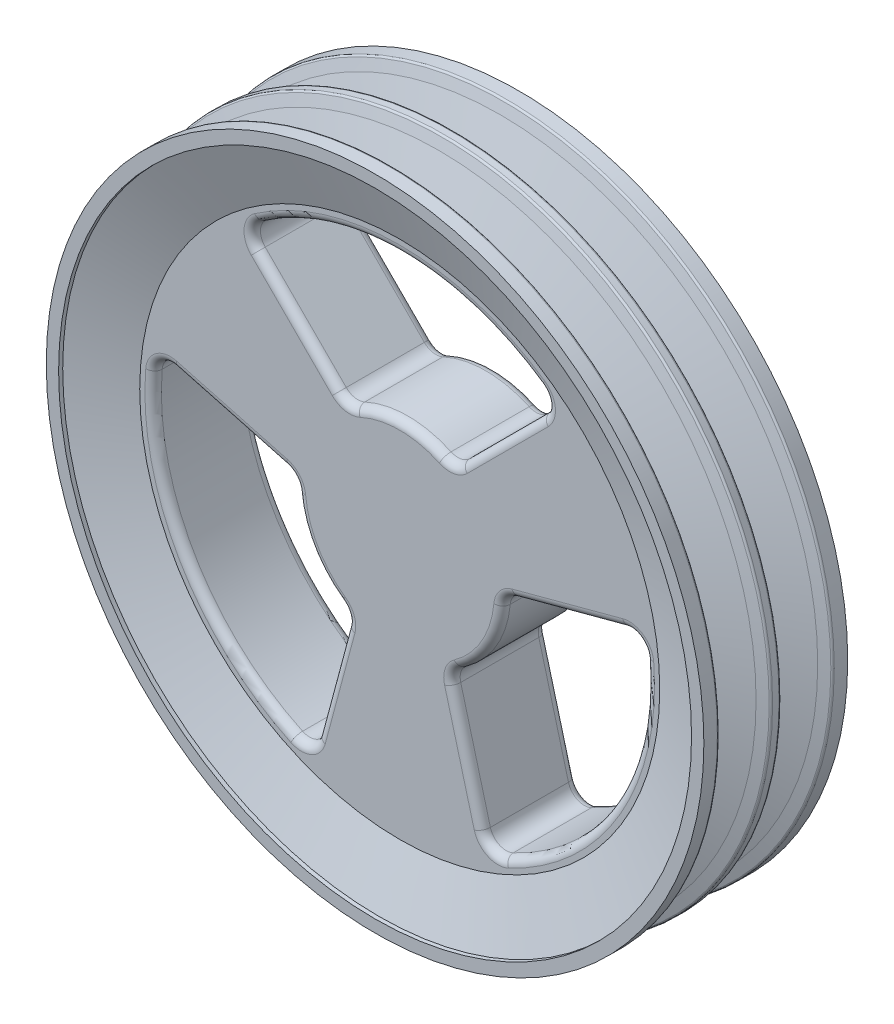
from build123d import *

# Parameters (mm, degrees)
SKIZZE1_R                         = 80
LINEAR_AUSTRAGEN1_DEPTH           = 17.5
VERRUNDUNG1_R                     = 0.5
LINEARES_MUSTER1_COUNT            = 2
LINEARES_MUSTER1_PITCH            = 15
VERRUNDUNG1_OF_LINEARES_MUSTER1_R = 0.5
SCHNITT_LINEAR_AUSTRAGEN1_DEPTH   = 115.482533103
VERRUNDUNG2_R                     = 2
KREISMUSTER1_COUNT                = 3
VERRUNDUNG2_OF_KREISMUSTER1_R     = 2


with BuildPart() as part:
    # Skizze1 → Linear austragen1 (new, symmetric)
    with BuildSketch(Plane.XY):
        Circle(SKIZZE1_R)
    extrude(amount=LINEAR_AUSTRAGEN1_DEPTH, both=True)

    # Skizze2 → Schnitt-Rotation1 (revolve, cut)
    with BuildSketch(Plane(origin=(0, 0, 0), x_dir=(0, 0, -1), z_dir=(1, 0, 0)), mode=Mode.PRIVATE) as schnitt_rotation1_sk:
        Polygon((-13.85, 80), (-13, 77.2), (-9.212396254, 66.2), (-5.787603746, 66.2), (-2, 77.2), (-1.15, 80), align=None)
    schnitt_rotation1 = revolve(schnitt_rotation1_sk.sketch.rotate(Axis((0, 0, 17.5), (0, 0, -1)), 90), axis=Axis((0, 0, 17.5), (0, 0, -1)), mode=Mode.SUBTRACT)

    # Verrundung1
    verrundung1_edges = [part.edges().sort_by_distance(p)[0] for p in [
        (-80, 0, 1.15),
        (-80, 0, 13.85),
        (-66.2, 0, 9.212396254),
        (-66.2, 0, 5.787603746),
    ]]
    fillet(verrundung1_edges, radius=VERRUNDUNG1_R)

    # Lineares Muster1: Schnitt-Rotation1 ×2
    with Locations(*[(0, 0, -i * LINEARES_MUSTER1_PITCH) for i in range(1, LINEARES_MUSTER1_COUNT)]):
        add(schnitt_rotation1, mode=Mode.SUBTRACT)

    # Verrundung1 of Lineares Muster1
    verrundung1_of_lineares_muster1_edges = [part.edges().sort_by_distance(p)[0] for p in [
        (-80, 0, -13.85),
        (-80, 0, -1.15),
        (-66.2, 0, -5.787603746),
        (-66.2, 0, -9.212396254),
    ]]
    fillet(verrundung1_of_lineares_muster1_edges, radius=VERRUNDUNG1_OF_LINEARES_MUSTER1_R)

    # Skizze3 → Schnitt-Rotation2 (revolve, cut)
    with BuildSketch(Plane(origin=(0, 0, 0), x_dir=(0, 0, -1), z_dir=(1, 0, 0)), mode=Mode.PRIVATE) as schnitt_rotation2_sk:
        Polygon((-11.5, 0), (-11.5, 63.262612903), (-16.5, 77), (-17.5, 77), (-17.5, 0), align=None)
        Polygon((17.5, 77), (16.5, 77), (11.5, 63.262612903), (11.5, 0), (17.5, 0), align=None)
    revolve(schnitt_rotation2_sk.sketch.rotate(Axis((0, 0, 17.5), (0, 0, -1)), 270), axis=Axis((0, 0, 17.5), (0, 0, -1)), mode=Mode.SUBTRACT)

    # Skizze4 → Schnitt-Linear austragen1 (cut, symmetric)
    with BuildSketch(Plane.XY):
        with BuildLine():
            Line((15.005735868, 23.491017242), (34.71887879, 43.204160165))
            ThreePointArc((34.71887879, 43.204160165), (35.874346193, 46.391173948), (34.16834107, 49.320629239))
            ThreePointArc((34.16834107, 49.320629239), (0, 60), (-34.16834107, 49.320629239))
            ThreePointArc((-34.16834107, 49.320629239), (-35.874346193, 46.391173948), (-34.71887879, 43.204160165))
            Line((-34.71887879, 43.204160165), (-15.005735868, 23.491017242))
            ThreePointArc((-15.005735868, 23.491017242), (-12.877788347, 22.38125591), (-10.497679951, 22.689176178))
            ThreePointArc((-10.497679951, 22.689176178), (0, 25), (10.497679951, 22.689176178))
            ThreePointArc((10.497679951, 22.689176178), (12.877788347, 22.38125591), (15.005735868, 23.491017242))
        make_face()
    schnitt_linear_austragen1 = extrude(amount=SCHNITT_LINEAR_AUSTRAGEN1_DEPTH, both=True, mode=Mode.SUBTRACT)

    # Verrundung2
    verrundung2_edges = [part.edges().sort_by_distance(p)[0] for p in [
        (-24.862307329, 33.347588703, -11.5),
        (-12.877788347, 22.38125591, -11.5),
        (0, 25, -11.5),
        (12.877788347, 22.38125591, -11.5),
        (24.862307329, 33.347588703, -11.5),
        (35.874346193, 46.391173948, -11.5),
        (0, 60, -11.5),
        (-35.874346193, 46.391173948, -11.5),
        (-35.874346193, 46.391173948, 11.5),
        (0, 60, 11.5),
        (35.874346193, 46.391173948, 11.5),
        (24.862307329, 33.347588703, 11.5),
        (12.877788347, 22.38125591, 11.5),
        (0, 25, 11.5),
        (-12.877788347, 22.38125591, 11.5),
        (-24.862307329, 33.347588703, 11.5),
    ]]
    fillet(verrundung2_edges, radius=VERRUNDUNG2_R)

    # Kreismuster1: Schnitt-Linear austragen1 ×3 about axis
    kreismuster1_axis = Axis((0, 0, 0), (0, 0, 1))
    for i in range(1, KREISMUSTER1_COUNT):
        add(schnitt_linear_austragen1.rotate(kreismuster1_axis, i * 360 / KREISMUSTER1_COUNT), mode=Mode.SUBTRACT)

    # Verrundung2 of Kreismuster1
    verrundung2_of_kreismuster1_edges = [part.edges().sort_by_distance(p)[0] for p in [
        (-16.448705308, -38.205184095, -11.5),
        (-12.943842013, -22.343119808, -11.5),
        (-21.650635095, -12.5, -11.5),
        (-25.82163036, -0.038136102, -11.5),
        (-41.311012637, 4.857595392, -11.5),
        (-58.113108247, 7.872508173, -11.5),
        (-51.961524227, -30, -11.5),
        (-22.238762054, -54.263682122, -11.5),
        (-22.238762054, -54.263682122, 11.5),
        (-51.961524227, -30, 11.5),
        (-58.113108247, 7.872508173, 11.5),
        (-41.311012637, 4.857595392, 11.5),
        (-25.82163036, -0.038136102, 11.5),
        (-21.650635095, -12.5, 11.5),
        (-12.943842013, -22.343119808, 11.5),
        (-16.448705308, -38.205184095, 11.5),
        (41.311012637, 4.857595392, -11.5),
        (25.82163036, -0.038136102, -11.5),
        (21.650635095, -12.5, -11.5),
        (12.943842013, -22.343119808, -11.5),
        (16.448705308, -38.205184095, -11.5),
        (22.238762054, -54.263682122, -11.5),
        (51.961524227, -30, -11.5),
        (58.113108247, 7.872508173, -11.5),
        (58.113108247, 7.872508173, 11.5),
        (51.961524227, -30, 11.5),
        (22.238762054, -54.263682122, 11.5),
        (16.448705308, -38.205184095, 11.5),
        (12.943842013, -22.343119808, 11.5),
        (21.650635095, -12.5, 11.5),
        (25.82163036, -0.038136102, 11.5),
        (41.311012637, 4.857595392, 11.5),
    ]]
    fillet(verrundung2_of_kreismuster1_edges, radius=VERRUNDUNG2_OF_KREISMUSTER1_R)


solid = part.part
